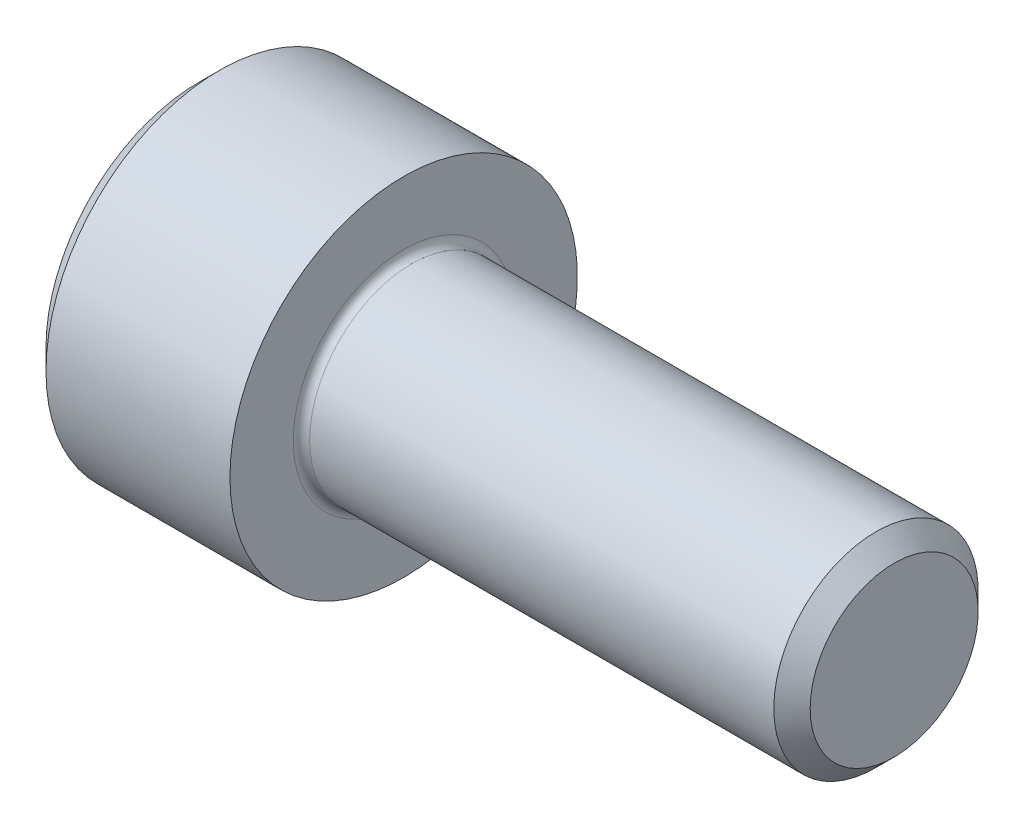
from build123d import *

# Parameters (mm, degrees)
FILLET1_R   = 0.2
HEX_2_DEPTH = 2.5


with BuildPart() as part:
    # BodySke → Base-Revolve (revolve)
    with BuildSketch(Plane.XY, mode=Mode.PRIVATE) as base_revolve_sk:
        Polygon((0, 0), (0, 3.75), (0.5, 4.25), (5, 4.25), (5, 2.5), (16.555, 2.5), (17, 2.055), (17, 0), align=None)
    revolve(base_revolve_sk.sketch.rotate(Axis((-31.75, 0, 0), (1, 0, 0)), 90), axis=Axis((-31.75, 0, 0), (1, 0, 0)))

    # Fillet1
    fillet1_edges = [part.edges().sort_by_distance(p)[0] for p in [
        (5, 0, -2.5),
    ]]
    fillet(fillet1_edges, radius=FILLET1_R)

    # Sketch2 → Hex-PreBroach (revolve, cut)
    with BuildSketch(Plane.XY, mode=Mode.PRIVATE) as hex_prebroach_sk:
        Polygon((0, 2.042), (2.5, 2.042), (3.67894925, 0), (0, 0), align=None)
    revolve(hex_prebroach_sk.sketch.rotate(Axis((0, 0, 0), (1, 0, 0)), 90), axis=Axis((0, 0, 0), (1, 0, 0)), mode=Mode.SUBTRACT)

    # Sketch3 → Hex 2 (cut)
    with BuildSketch(Plane(origin=(0, 0, 0), x_dir=(0, 0.500000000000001, 0.866025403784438), z_dir=(-1, 0, 0))):
        Polygon((1.17894925, 2.042), (-1.17894925, 2.042), (-2.357898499, 0), (-1.17894925, -2.042), (1.17894925, -2.042), (2.357898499, 0), align=None)
    extrude(amount=-HEX_2_DEPTH, mode=Mode.SUBTRACT)


solid = part.part
